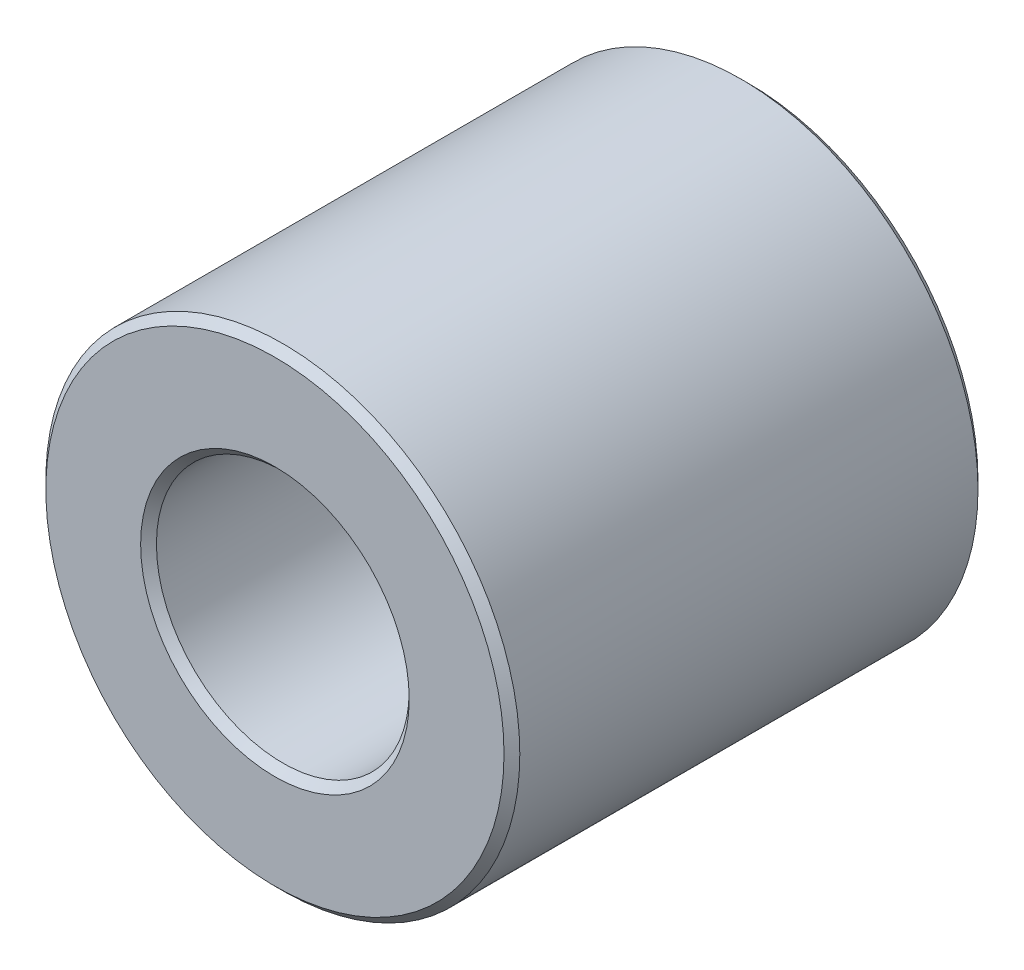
ISO-10303-21;
HEADER;
FILE_DESCRIPTION(('STEP AP214'),'2;1');
FILE_NAME('part.step','',(''),(''),'','','');
FILE_SCHEMA(('AUTOMOTIVE_DESIGN { 1 0 10303 214 1 1 1 1 }'));
ENDSEC;
DATA;
#1=APPLICATION_CONTEXT('core data for automotive mechanical design processes');
#2=APPLICATION_PROTOCOL_DEFINITION('international standard','automotive_design',2000,#1);
#3=PRODUCT_CONTEXT('',#1,'mechanical');
#4=PRODUCT('Part','Part','',(#3));
#5=PRODUCT_RELATED_PRODUCT_CATEGORY('part','',(#4));
#6=PRODUCT_DEFINITION_FORMATION('','',#4);
#7=PRODUCT_DEFINITION_CONTEXT('part definition',#1,'design');
#8=PRODUCT_DEFINITION('design','',#6,#7);
#9=PRODUCT_DEFINITION_SHAPE('','',#8);
#10=(LENGTH_UNIT() NAMED_UNIT(*) SI_UNIT(.MILLI.,.METRE.));
#11=(NAMED_UNIT(*) PLANE_ANGLE_UNIT() SI_UNIT($,.RADIAN.));
#12=(NAMED_UNIT(*) SI_UNIT($,.STERADIAN.) SOLID_ANGLE_UNIT());
#13=UNCERTAINTY_MEASURE_WITH_UNIT(LENGTH_MEASURE(1.E-05),#10,'distance_accuracy_value','');
#14=(GEOMETRIC_REPRESENTATION_CONTEXT(3) GLOBAL_UNCERTAINTY_ASSIGNED_CONTEXT((#13)) GLOBAL_UNIT_ASSIGNED_CONTEXT((#10,
#11,#12)) REPRESENTATION_CONTEXT('',''));
#15=CARTESIAN_POINT('',(0.,0.,0.));
#16=DIRECTION('',(0.,0.,1.));
#17=DIRECTION('',(1.,0.,0.));
#18=AXIS2_PLACEMENT_3D('',#15,#16,#17);
#19=CARTESIAN_POINT('',(0.,0.,3.));
#20=DIRECTION('',(0.,0.,1.));
#21=DIRECTION('',(1.,0.,0.));
#22=AXIS2_PLACEMENT_3D('',#19,#20,#21);
#23=PLANE('',#22);
#24=CARTESIAN_POINT('',(0.,0.,3.));
#25=DIRECTION('',(0.,0.,1.));
#26=DIRECTION('',(1.,0.,0.));
#27=AXIS2_PLACEMENT_3D('',#24,#25,#26);
#28=CIRCLE('',#27,1.7);
#29=CARTESIAN_POINT('',(1.7,0.,3.));
#30=VERTEX_POINT('',#29);
#31=EDGE_CURVE('E10',#30,#30,#28,.F.);
#32=ORIENTED_EDGE('',*,*,#31,.T.);
#33=EDGE_LOOP('',(#32));
#34=FACE_BOUND('',#33,.T.);
#35=CARTESIAN_POINT('',(0.,0.,3.));
#36=DIRECTION('',(0.,0.,1.));
#37=DIRECTION('',(1.,0.,0.));
#38=AXIS2_PLACEMENT_3D('',#35,#36,#37);
#39=CIRCLE('',#38,2.9);
#40=CARTESIAN_POINT('',(2.9,0.,3.));
#41=VERTEX_POINT('',#40);
#42=EDGE_CURVE('E45',#41,#41,#39,.T.);
#43=ORIENTED_EDGE('',*,*,#42,.T.);
#44=EDGE_LOOP('',(#43));
#45=FACE_BOUND('',#44,.T.);
#46=ADVANCED_FACE('F37',(#34,#45),#23,.T.);
#47=CARTESIAN_POINT('',(0.,0.,-3.));
#48=DIRECTION('',(0.,0.,1.));
#49=DIRECTION('',(1.,0.,0.));
#50=AXIS2_PLACEMENT_3D('',#47,#48,#49);
#51=PLANE('',#50);
#52=CARTESIAN_POINT('',(0.,0.,-3.));
#53=DIRECTION('',(0.,0.,1.));
#54=DIRECTION('',(1.,0.,0.));
#55=AXIS2_PLACEMENT_3D('',#52,#53,#54);
#56=CIRCLE('',#55,2.9);
#57=CARTESIAN_POINT('',(2.9,0.,-3.));
#58=VERTEX_POINT('',#57);
#59=EDGE_CURVE('E63',#58,#58,#56,.F.);
#60=ORIENTED_EDGE('',*,*,#59,.T.);
#61=EDGE_LOOP('',(#60));
#62=FACE_BOUND('',#61,.T.);
#63=CARTESIAN_POINT('',(0.,0.,-3.));
#64=DIRECTION('',(0.,0.,1.));
#65=DIRECTION('',(1.,0.,0.));
#66=AXIS2_PLACEMENT_3D('',#63,#64,#65);
#67=CIRCLE('',#66,1.7);
#68=CARTESIAN_POINT('',(1.7,0.,-3.));
#69=VERTEX_POINT('',#68);
#70=EDGE_CURVE('E66',#69,#69,#67,.T.);
#71=ORIENTED_EDGE('',*,*,#70,.T.);
#72=EDGE_LOOP('',(#71));
#73=FACE_BOUND('',#72,.T.);
#74=ADVANCED_FACE('F89',(#62,#73),#51,.F.);
#75=CARTESIAN_POINT('',(0.,0.,3.));
#76=DIRECTION('',(0.,0.,-1.));
#77=DIRECTION('',(-1.,0.,0.));
#78=AXIS2_PLACEMENT_3D('',#75,#76,#77);
#79=CYLINDRICAL_SURFACE('',#78,3.);
#80=CARTESIAN_POINT('',(0.,0.,-2.9));
#81=DIRECTION('',(0.,0.,1.));
#82=DIRECTION('',(1.,0.,0.));
#83=AXIS2_PLACEMENT_3D('',#80,#81,#82);
#84=CIRCLE('',#83,3.);
#85=CARTESIAN_POINT('',(3.,0.,-2.9));
#86=VERTEX_POINT('',#85);
#87=EDGE_CURVE('E69',#86,#86,#84,.T.);
#88=ORIENTED_EDGE('',*,*,#87,.T.);
#89=EDGE_LOOP('',(#88));
#90=FACE_BOUND('',#89,.T.);
#91=CARTESIAN_POINT('',(0.,0.,2.9));
#92=DIRECTION('',(0.,0.,1.));
#93=DIRECTION('',(1.,0.,0.));
#94=AXIS2_PLACEMENT_3D('',#91,#92,#93);
#95=CIRCLE('',#94,3.);
#96=CARTESIAN_POINT('',(3.,0.,2.9));
#97=VERTEX_POINT('',#96);
#98=EDGE_CURVE('E73',#97,#97,#95,.F.);
#99=ORIENTED_EDGE('',*,*,#98,.T.);
#100=EDGE_LOOP('',(#99));
#101=FACE_BOUND('',#100,.T.);
#102=ADVANCED_FACE('F78',(#90,#101),#79,.T.);
#103=CARTESIAN_POINT('',(0.,0.,3.));
#104=DIRECTION('',(0.,0.,-1.));
#105=DIRECTION('',(-1.,0.,0.));
#106=AXIS2_PLACEMENT_3D('',#103,#104,#105);
#107=CYLINDRICAL_SURFACE('',#106,1.6);
#108=CARTESIAN_POINT('',(0.,0.,-2.9));
#109=DIRECTION('',(0.,0.,1.));
#110=DIRECTION('',(1.,0.,0.));
#111=AXIS2_PLACEMENT_3D('',#108,#109,#110);
#112=CIRCLE('',#111,1.6);
#113=CARTESIAN_POINT('',(1.6,0.,-2.9));
#114=VERTEX_POINT('',#113);
#115=EDGE_CURVE('E52',#114,#114,#112,.F.);
#116=ORIENTED_EDGE('',*,*,#115,.T.);
#117=EDGE_LOOP('',(#116));
#118=FACE_BOUND('',#117,.T.);
#119=CARTESIAN_POINT('',(0.,0.,2.9));
#120=DIRECTION('',(0.,0.,1.));
#121=DIRECTION('',(1.,0.,0.));
#122=AXIS2_PLACEMENT_3D('',#119,#120,#121);
#123=CIRCLE('',#122,1.6);
#124=CARTESIAN_POINT('',(1.6,0.,2.9));
#125=VERTEX_POINT('',#124);
#126=EDGE_CURVE('E58',#125,#125,#123,.T.);
#127=ORIENTED_EDGE('',*,*,#126,.T.);
#128=EDGE_LOOP('',(#127));
#129=FACE_BOUND('',#128,.T.);
#130=ADVANCED_FACE('F97',(#118,#129),#107,.F.);
#131=CARTESIAN_POINT('',(0.,0.,-2.9));
#132=DIRECTION('',(0.,0.,1.));
#133=DIRECTION('',(1.,0.,0.));
#134=AXIS2_PLACEMENT_3D('',#131,#132,#133);
#135=CONICAL_SURFACE('',#134,3.,0.785398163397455);
#136=ORIENTED_EDGE('',*,*,#59,.F.);
#137=EDGE_LOOP('',(#136));
#138=FACE_BOUND('',#137,.T.);
#139=ORIENTED_EDGE('',*,*,#87,.F.);
#140=EDGE_LOOP('',(#139));
#141=FACE_BOUND('',#140,.T.);
#142=ADVANCED_FACE('F102',(#138,#141),#135,.T.);
#143=CARTESIAN_POINT('',(0.,0.,-3.));
#144=DIRECTION('',(0.,0.,-1.));
#145=DIRECTION('',(-1.,0.,0.));
#146=AXIS2_PLACEMENT_3D('',#143,#144,#145);
#147=CONICAL_SURFACE('',#146,1.7,0.785398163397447);
#148=ORIENTED_EDGE('',*,*,#115,.F.);
#149=EDGE_LOOP('',(#148));
#150=FACE_BOUND('',#149,.T.);
#151=ORIENTED_EDGE('',*,*,#70,.F.);
#152=EDGE_LOOP('',(#151));
#153=FACE_BOUND('',#152,.T.);
#154=ADVANCED_FACE('F86',(#150,#153),#147,.F.);
#155=CARTESIAN_POINT('',(0.,0.,2.9));
#156=DIRECTION('',(0.,0.,1.));
#157=DIRECTION('',(1.,0.,0.));
#158=AXIS2_PLACEMENT_3D('',#155,#156,#157);
#159=CONICAL_SURFACE('',#158,1.6,0.785398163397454);
#160=ORIENTED_EDGE('',*,*,#31,.F.);
#161=EDGE_LOOP('',(#160));
#162=FACE_BOUND('',#161,.T.);
#163=ORIENTED_EDGE('',*,*,#126,.F.);
#164=EDGE_LOOP('',(#163));
#165=FACE_BOUND('',#164,.T.);
#166=ADVANCED_FACE('F82',(#162,#165),#159,.F.);
#167=CARTESIAN_POINT('',(0.,0.,3.));
#168=DIRECTION('',(0.,0.,-1.));
#169=DIRECTION('',(-1.,0.,0.));
#170=AXIS2_PLACEMENT_3D('',#167,#168,#169);
#171=CONICAL_SURFACE('',#170,2.9,0.785398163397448);
#172=ORIENTED_EDGE('',*,*,#98,.F.);
#173=EDGE_LOOP('',(#172));
#174=FACE_BOUND('',#173,.T.);
#175=ORIENTED_EDGE('',*,*,#42,.F.);
#176=EDGE_LOOP('',(#175));
#177=FACE_BOUND('',#176,.T.);
#178=ADVANCED_FACE('F39',(#174,#177),#171,.T.);
#179=CLOSED_SHELL('',(#46,#74,#102,#130,#142,#154,#166,#178));
#180=MANIFOLD_SOLID_BREP('B2',#179);
#181=ADVANCED_BREP_SHAPE_REPRESENTATION('',(#18,#180),#14);
#182=SHAPE_DEFINITION_REPRESENTATION(#9,#181);
ENDSEC;
END-ISO-10303-21;
